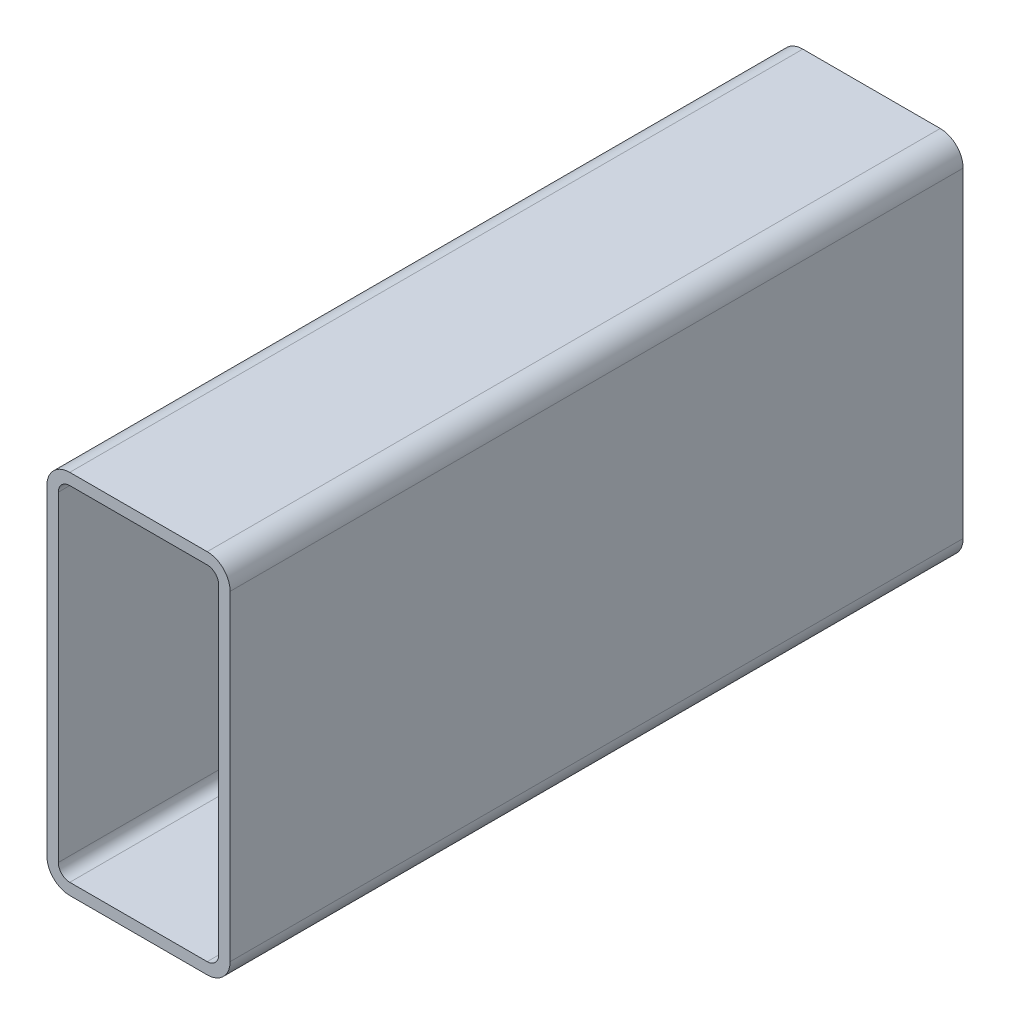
ISO-10303-21;
HEADER;
FILE_DESCRIPTION(('STEP AP214'),'2;1');
FILE_NAME('part.step','',(''),(''),'','','');
FILE_SCHEMA(('AUTOMOTIVE_DESIGN { 1 0 10303 214 1 1 1 1 }'));
ENDSEC;
DATA;
#1=APPLICATION_CONTEXT('core data for automotive mechanical design processes');
#2=APPLICATION_PROTOCOL_DEFINITION('international standard','automotive_design',2000,#1);
#3=PRODUCT_CONTEXT('',#1,'mechanical');
#4=PRODUCT('Part','Part','',(#3));
#5=PRODUCT_RELATED_PRODUCT_CATEGORY('part','',(#4));
#6=PRODUCT_DEFINITION_FORMATION('','',#4);
#7=PRODUCT_DEFINITION_CONTEXT('part definition',#1,'design');
#8=PRODUCT_DEFINITION('design','',#6,#7);
#9=PRODUCT_DEFINITION_SHAPE('','',#8);
#10=(LENGTH_UNIT() NAMED_UNIT(*) SI_UNIT(.MILLI.,.METRE.));
#11=(NAMED_UNIT(*) PLANE_ANGLE_UNIT() SI_UNIT($,.RADIAN.));
#12=(NAMED_UNIT(*) SI_UNIT($,.STERADIAN.) SOLID_ANGLE_UNIT());
#13=UNCERTAINTY_MEASURE_WITH_UNIT(LENGTH_MEASURE(1.E-05),#10,'distance_accuracy_value','');
#14=(GEOMETRIC_REPRESENTATION_CONTEXT(3) GLOBAL_UNCERTAINTY_ASSIGNED_CONTEXT((#13)) GLOBAL_UNIT_ASSIGNED_CONTEXT((#10,
#11,#12)) REPRESENTATION_CONTEXT('',''));
#15=CARTESIAN_POINT('',(0.,0.,0.));
#16=DIRECTION('',(0.,0.,1.));
#17=DIRECTION('',(1.,0.,0.));
#18=AXIS2_PLACEMENT_3D('',#15,#16,#17);
#19=CARTESIAN_POINT('',(12.0141160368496,144.886948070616,304.8));
#20=DIRECTION('',(0.,0.,1.));
#21=DIRECTION('',(1.,0.,0.));
#22=AXIS2_PLACEMENT_3D('',#19,#20,#21);
#23=PLANE('',#22);
#24=CARTESIAN_POINT('',(12.0141160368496,144.886948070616,304.8));
#25=DIRECTION('',(0.,0.,1.));
#26=DIRECTION('',(1.,0.,0.));
#27=AXIS2_PLACEMENT_3D('',#24,#25,#26);
#28=CIRCLE('',#27,9.52500000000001);
#29=CARTESIAN_POINT('',(12.0141160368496,154.411948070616,304.8));
#30=VERTEX_POINT('',#29);
#31=CARTESIAN_POINT('',(2.48911603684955,144.886948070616,304.8));
#32=VERTEX_POINT('',#31);
#33=EDGE_CURVE('E211',#30,#32,#28,.T.);
#34=ORIENTED_EDGE('',*,*,#33,.T.);
#35=DIRECTION('',(0.,-1.,0.));
#36=VECTOR('',#35,1.);
#37=CARTESIAN_POINT('',(2.48911603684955,11.5369480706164,304.8));
#38=LINE('',#37,#36);
#39=CARTESIAN_POINT('',(2.48911603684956,11.5369480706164,304.8));
#40=VERTEX_POINT('',#39);
#41=EDGE_CURVE('E214',#32,#40,#38,.T.);
#42=ORIENTED_EDGE('',*,*,#41,.T.);
#43=CARTESIAN_POINT('',(12.0141160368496,11.5369480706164,304.8));
#44=DIRECTION('',(0.,0.,1.));
#45=DIRECTION('',(1.,0.,0.));
#46=AXIS2_PLACEMENT_3D('',#43,#44,#45);
#47=CIRCLE('',#46,9.525);
#48=CARTESIAN_POINT('',(12.0141160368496,2.01194807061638,304.8));
#49=VERTEX_POINT('',#48);
#50=EDGE_CURVE('E217',#40,#49,#47,.T.);
#51=ORIENTED_EDGE('',*,*,#50,.T.);
#52=DIRECTION('',(1.,0.,0.));
#53=VECTOR('',#52,1.);
#54=CARTESIAN_POINT('',(69.1641160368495,2.01194807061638,304.8));
#55=LINE('',#54,#53);
#56=CARTESIAN_POINT('',(69.1641160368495,2.01194807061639,304.8));
#57=VERTEX_POINT('',#56);
#58=EDGE_CURVE('E219',#49,#57,#55,.T.);
#59=ORIENTED_EDGE('',*,*,#58,.T.);
#60=CARTESIAN_POINT('',(69.1641160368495,11.5369480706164,304.8));
#61=DIRECTION('',(0.,0.,1.));
#62=DIRECTION('',(1.,0.,0.));
#63=AXIS2_PLACEMENT_3D('',#60,#61,#62);
#64=CIRCLE('',#63,9.525);
#65=CARTESIAN_POINT('',(78.6891160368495,11.5369480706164,304.8));
#66=VERTEX_POINT('',#65);
#67=EDGE_CURVE('E221',#57,#66,#64,.T.);
#68=ORIENTED_EDGE('',*,*,#67,.T.);
#69=DIRECTION('',(0.,1.,0.));
#70=VECTOR('',#69,1.);
#71=CARTESIAN_POINT('',(78.6891160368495,144.886948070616,304.8));
#72=LINE('',#71,#70);
#73=CARTESIAN_POINT('',(78.6891160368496,144.886948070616,304.8));
#74=VERTEX_POINT('',#73);
#75=EDGE_CURVE('E223',#66,#74,#72,.T.);
#76=ORIENTED_EDGE('',*,*,#75,.T.);
#77=CARTESIAN_POINT('',(69.1641160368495,144.886948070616,304.8));
#78=DIRECTION('',(0.,0.,1.));
#79=DIRECTION('',(1.,0.,0.));
#80=AXIS2_PLACEMENT_3D('',#77,#78,#79);
#81=CIRCLE('',#80,9.525);
#82=CARTESIAN_POINT('',(69.1641160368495,154.411948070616,304.8));
#83=VERTEX_POINT('',#82);
#84=EDGE_CURVE('E225',#74,#83,#81,.T.);
#85=ORIENTED_EDGE('',*,*,#84,.T.);
#86=DIRECTION('',(-1.,0.,0.));
#87=VECTOR('',#86,1.);
#88=CARTESIAN_POINT('',(12.0141160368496,154.411948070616,304.8));
#89=LINE('',#88,#87);
#90=EDGE_CURVE('E227',#83,#30,#89,.T.);
#91=ORIENTED_EDGE('',*,*,#90,.T.);
#92=EDGE_LOOP('',(#34,#42,#51,#59,#68,#76,#85,#91));
#93=FACE_BOUND('',#92,.T.);
#94=DIRECTION('',(0.,-1.,0.));
#95=VECTOR('',#94,1.);
#96=CARTESIAN_POINT('',(7.25161603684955,11.5369480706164,304.8));
#97=LINE('',#96,#95);
#98=CARTESIAN_POINT('',(7.25161603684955,144.886948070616,304.8));
#99=VERTEX_POINT('',#98);
#100=CARTESIAN_POINT('',(7.25161603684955,11.5369480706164,304.8));
#101=VERTEX_POINT('',#100);
#102=EDGE_CURVE('E154',#99,#101,#97,.T.);
#103=ORIENTED_EDGE('',*,*,#102,.F.);
#104=CARTESIAN_POINT('',(12.0141160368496,144.886948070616,304.8));
#105=DIRECTION('',(0.,0.,1.));
#106=DIRECTION('',(1.,0.,0.));
#107=AXIS2_PLACEMENT_3D('',#104,#105,#106);
#108=CIRCLE('',#107,4.7625);
#109=CARTESIAN_POINT('',(12.0141160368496,149.649448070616,304.8));
#110=VERTEX_POINT('',#109);
#111=EDGE_CURVE('E146',#110,#99,#108,.T.);
#112=ORIENTED_EDGE('',*,*,#111,.F.);
#113=DIRECTION('',(-1.,0.,0.));
#114=VECTOR('',#113,1.);
#115=CARTESIAN_POINT('',(12.0141160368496,149.649448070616,304.8));
#116=LINE('',#115,#114);
#117=CARTESIAN_POINT('',(69.1641160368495,149.649448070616,304.8));
#118=VERTEX_POINT('',#117);
#119=EDGE_CURVE('E179',#118,#110,#116,.T.);
#120=ORIENTED_EDGE('',*,*,#119,.F.);
#121=CARTESIAN_POINT('',(69.1641160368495,144.886948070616,304.8));
#122=DIRECTION('',(0.,0.,1.));
#123=DIRECTION('',(1.,0.,0.));
#124=AXIS2_PLACEMENT_3D('',#121,#122,#123);
#125=CIRCLE('',#124,4.7625);
#126=CARTESIAN_POINT('',(73.9266160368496,144.886948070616,304.8));
#127=VERTEX_POINT('',#126);
#128=EDGE_CURVE('E177',#127,#118,#125,.T.);
#129=ORIENTED_EDGE('',*,*,#128,.F.);
#130=DIRECTION('',(0.,1.,0.));
#131=VECTOR('',#130,1.);
#132=CARTESIAN_POINT('',(73.9266160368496,144.886948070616,304.8));
#133=LINE('',#132,#131);
#134=CARTESIAN_POINT('',(73.9266160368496,11.5369480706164,304.8));
#135=VERTEX_POINT('',#134);
#136=EDGE_CURVE('E175',#135,#127,#133,.T.);
#137=ORIENTED_EDGE('',*,*,#136,.F.);
#138=CARTESIAN_POINT('',(69.1641160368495,11.5369480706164,304.8));
#139=DIRECTION('',(0.,0.,1.));
#140=DIRECTION('',(1.,0.,0.));
#141=AXIS2_PLACEMENT_3D('',#138,#139,#140);
#142=CIRCLE('',#141,4.7625);
#143=CARTESIAN_POINT('',(69.1641160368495,6.77444807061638,304.8));
#144=VERTEX_POINT('',#143);
#145=EDGE_CURVE('E173',#144,#135,#142,.T.);
#146=ORIENTED_EDGE('',*,*,#145,.F.);
#147=DIRECTION('',(1.,0.,0.));
#148=VECTOR('',#147,1.);
#149=CARTESIAN_POINT('',(69.1641160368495,6.77444807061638,304.8));
#150=LINE('',#149,#148);
#151=CARTESIAN_POINT('',(12.0141160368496,6.77444807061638,304.8));
#152=VERTEX_POINT('',#151);
#153=EDGE_CURVE('E169',#152,#144,#150,.T.);
#154=ORIENTED_EDGE('',*,*,#153,.F.);
#155=CARTESIAN_POINT('',(12.0141160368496,11.5369480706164,304.8));
#156=DIRECTION('',(0.,0.,1.));
#157=DIRECTION('',(1.,0.,0.));
#158=AXIS2_PLACEMENT_3D('',#155,#156,#157);
#159=CIRCLE('',#158,4.7625);
#160=EDGE_CURVE('E167',#101,#152,#159,.T.);
#161=ORIENTED_EDGE('',*,*,#160,.F.);
#162=EDGE_LOOP('',(#103,#112,#120,#129,#137,#146,#154,#161));
#163=FACE_BOUND('',#162,.T.);
#164=ADVANCED_FACE('F33',(#93,#163),#23,.T.);
#165=CARTESIAN_POINT('',(12.0141160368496,144.886948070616,0.));
#166=DIRECTION('',(0.,0.,1.));
#167=DIRECTION('',(1.,0.,0.));
#168=AXIS2_PLACEMENT_3D('',#165,#166,#167);
#169=PLANE('',#168);
#170=CARTESIAN_POINT('',(12.0141160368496,144.886948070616,0.));
#171=DIRECTION('',(0.,0.,1.));
#172=DIRECTION('',(1.,0.,0.));
#173=AXIS2_PLACEMENT_3D('',#170,#171,#172);
#174=CIRCLE('',#173,9.52500000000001);
#175=CARTESIAN_POINT('',(12.0141160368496,154.411948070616,0.));
#176=VERTEX_POINT('',#175);
#177=CARTESIAN_POINT('',(2.48911603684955,144.886948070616,0.));
#178=VERTEX_POINT('',#177);
#179=EDGE_CURVE('E162',#176,#178,#174,.T.);
#180=ORIENTED_EDGE('',*,*,#179,.F.);
#181=DIRECTION('',(-1.,0.,0.));
#182=VECTOR('',#181,1.);
#183=CARTESIAN_POINT('',(12.0141160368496,154.411948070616,0.));
#184=LINE('',#183,#182);
#185=CARTESIAN_POINT('',(69.1641160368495,154.411948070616,0.));
#186=VERTEX_POINT('',#185);
#187=EDGE_CURVE('E215',#186,#176,#184,.T.);
#188=ORIENTED_EDGE('',*,*,#187,.F.);
#189=CARTESIAN_POINT('',(69.1641160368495,144.886948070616,0.));
#190=DIRECTION('',(0.,0.,1.));
#191=DIRECTION('',(1.,0.,0.));
#192=AXIS2_PLACEMENT_3D('',#189,#190,#191);
#193=CIRCLE('',#192,9.525);
#194=CARTESIAN_POINT('',(78.6891160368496,144.886948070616,0.));
#195=VERTEX_POINT('',#194);
#196=EDGE_CURVE('E242',#195,#186,#193,.T.);
#197=ORIENTED_EDGE('',*,*,#196,.F.);
#198=DIRECTION('',(0.,1.,0.));
#199=VECTOR('',#198,1.);
#200=CARTESIAN_POINT('',(78.6891160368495,144.886948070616,0.));
#201=LINE('',#200,#199);
#202=CARTESIAN_POINT('',(78.6891160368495,11.5369480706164,0.));
#203=VERTEX_POINT('',#202);
#204=EDGE_CURVE('E240',#203,#195,#201,.T.);
#205=ORIENTED_EDGE('',*,*,#204,.F.);
#206=CARTESIAN_POINT('',(69.1641160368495,11.5369480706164,0.));
#207=DIRECTION('',(0.,0.,1.));
#208=DIRECTION('',(1.,0.,0.));
#209=AXIS2_PLACEMENT_3D('',#206,#207,#208);
#210=CIRCLE('',#209,9.525);
#211=CARTESIAN_POINT('',(69.1641160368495,2.01194807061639,0.));
#212=VERTEX_POINT('',#211);
#213=EDGE_CURVE('E238',#212,#203,#210,.T.);
#214=ORIENTED_EDGE('',*,*,#213,.F.);
#215=DIRECTION('',(1.,0.,0.));
#216=VECTOR('',#215,1.);
#217=CARTESIAN_POINT('',(69.1641160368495,2.01194807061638,0.));
#218=LINE('',#217,#216);
#219=CARTESIAN_POINT('',(12.0141160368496,2.01194807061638,0.));
#220=VERTEX_POINT('',#219);
#221=EDGE_CURVE('E236',#220,#212,#218,.T.);
#222=ORIENTED_EDGE('',*,*,#221,.F.);
#223=CARTESIAN_POINT('',(12.0141160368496,11.5369480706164,0.));
#224=DIRECTION('',(0.,0.,1.));
#225=DIRECTION('',(1.,0.,0.));
#226=AXIS2_PLACEMENT_3D('',#223,#224,#225);
#227=CIRCLE('',#226,9.525);
#228=CARTESIAN_POINT('',(2.48911603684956,11.5369480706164,0.));
#229=VERTEX_POINT('',#228);
#230=EDGE_CURVE('E234',#229,#220,#227,.T.);
#231=ORIENTED_EDGE('',*,*,#230,.F.);
#232=DIRECTION('',(0.,-1.,0.));
#233=VECTOR('',#232,1.);
#234=CARTESIAN_POINT('',(2.48911603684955,11.5369480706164,0.));
#235=LINE('',#234,#233);
#236=EDGE_CURVE('E232',#178,#229,#235,.T.);
#237=ORIENTED_EDGE('',*,*,#236,.F.);
#238=EDGE_LOOP('',(#180,#188,#197,#205,#214,#222,#231,#237));
#239=FACE_BOUND('',#238,.T.);
#240=CARTESIAN_POINT('',(12.0141160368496,144.886948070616,0.));
#241=DIRECTION('',(0.,0.,1.));
#242=DIRECTION('',(1.,0.,0.));
#243=AXIS2_PLACEMENT_3D('',#240,#241,#242);
#244=CIRCLE('',#243,4.7625);
#245=CARTESIAN_POINT('',(12.0141160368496,149.649448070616,0.));
#246=VERTEX_POINT('',#245);
#247=CARTESIAN_POINT('',(7.25161603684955,144.886948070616,0.));
#248=VERTEX_POINT('',#247);
#249=EDGE_CURVE('E56',#246,#248,#244,.T.);
#250=ORIENTED_EDGE('',*,*,#249,.T.);
#251=DIRECTION('',(0.,-1.,0.));
#252=VECTOR('',#251,1.);
#253=CARTESIAN_POINT('',(7.25161603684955,11.5369480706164,0.));
#254=LINE('',#253,#252);
#255=CARTESIAN_POINT('',(7.25161603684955,11.5369480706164,0.));
#256=VERTEX_POINT('',#255);
#257=EDGE_CURVE('E161',#248,#256,#254,.T.);
#258=ORIENTED_EDGE('',*,*,#257,.T.);
#259=CARTESIAN_POINT('',(12.0141160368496,11.5369480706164,0.));
#260=DIRECTION('',(0.,0.,1.));
#261=DIRECTION('',(1.,0.,0.));
#262=AXIS2_PLACEMENT_3D('',#259,#260,#261);
#263=CIRCLE('',#262,4.7625);
#264=CARTESIAN_POINT('',(12.0141160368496,6.77444807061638,0.));
#265=VERTEX_POINT('',#264);
#266=EDGE_CURVE('E183',#256,#265,#263,.T.);
#267=ORIENTED_EDGE('',*,*,#266,.T.);
#268=DIRECTION('',(1.,0.,0.));
#269=VECTOR('',#268,1.);
#270=CARTESIAN_POINT('',(69.1641160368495,6.77444807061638,0.));
#271=LINE('',#270,#269);
#272=CARTESIAN_POINT('',(69.1641160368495,6.77444807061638,0.));
#273=VERTEX_POINT('',#272);
#274=EDGE_CURVE('E186',#265,#273,#271,.T.);
#275=ORIENTED_EDGE('',*,*,#274,.T.);
#276=CARTESIAN_POINT('',(69.1641160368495,11.5369480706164,0.));
#277=DIRECTION('',(0.,0.,1.));
#278=DIRECTION('',(1.,0.,0.));
#279=AXIS2_PLACEMENT_3D('',#276,#277,#278);
#280=CIRCLE('',#279,4.7625);
#281=CARTESIAN_POINT('',(73.9266160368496,11.5369480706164,0.));
#282=VERTEX_POINT('',#281);
#283=EDGE_CURVE('E189',#273,#282,#280,.T.);
#284=ORIENTED_EDGE('',*,*,#283,.T.);
#285=DIRECTION('',(0.,1.,0.));
#286=VECTOR('',#285,1.);
#287=CARTESIAN_POINT('',(73.9266160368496,144.886948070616,0.));
#288=LINE('',#287,#286);
#289=CARTESIAN_POINT('',(73.9266160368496,144.886948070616,0.));
#290=VERTEX_POINT('',#289);
#291=EDGE_CURVE('E192',#282,#290,#288,.T.);
#292=ORIENTED_EDGE('',*,*,#291,.T.);
#293=CARTESIAN_POINT('',(69.1641160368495,144.886948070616,0.));
#294=DIRECTION('',(0.,0.,1.));
#295=DIRECTION('',(1.,0.,0.));
#296=AXIS2_PLACEMENT_3D('',#293,#294,#295);
#297=CIRCLE('',#296,4.7625);
#298=CARTESIAN_POINT('',(69.1641160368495,149.649448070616,0.));
#299=VERTEX_POINT('',#298);
#300=EDGE_CURVE('E195',#290,#299,#297,.T.);
#301=ORIENTED_EDGE('',*,*,#300,.T.);
#302=DIRECTION('',(-1.,0.,0.));
#303=VECTOR('',#302,1.);
#304=CARTESIAN_POINT('',(12.0141160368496,149.649448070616,0.));
#305=LINE('',#304,#303);
#306=EDGE_CURVE('E155',#299,#246,#305,.T.);
#307=ORIENTED_EDGE('',*,*,#306,.T.);
#308=EDGE_LOOP('',(#250,#258,#267,#275,#284,#292,#301,#307));
#309=FACE_BOUND('',#308,.T.);
#310=ADVANCED_FACE('F272',(#239,#309),#169,.F.);
#311=CARTESIAN_POINT('',(12.0141160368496,144.886948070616,304.8));
#312=DIRECTION('',(0.,0.,-1.));
#313=DIRECTION('',(-1.,0.,0.));
#314=AXIS2_PLACEMENT_3D('',#311,#312,#313);
#315=CYLINDRICAL_SURFACE('',#314,9.52500000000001);
#316=ORIENTED_EDGE('',*,*,#179,.T.);
#317=DIRECTION('',(0.,0.,-1.));
#318=VECTOR('',#317,1.);
#319=CARTESIAN_POINT('',(2.48911603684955,144.886948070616,304.8));
#320=LINE('',#319,#318);
#321=EDGE_CURVE('E11',#32,#178,#320,.T.);
#322=ORIENTED_EDGE('',*,*,#321,.F.);
#323=ORIENTED_EDGE('',*,*,#33,.F.);
#324=DIRECTION('',(0.,0.,-1.));
#325=VECTOR('',#324,1.);
#326=CARTESIAN_POINT('',(12.0141160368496,154.411948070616,304.8));
#327=LINE('',#326,#325);
#328=EDGE_CURVE('E229',#30,#176,#327,.T.);
#329=ORIENTED_EDGE('',*,*,#328,.T.);
#330=EDGE_LOOP('',(#316,#322,#323,#329));
#331=FACE_BOUND('',#330,.T.);
#332=ADVANCED_FACE('F35',(#331),#315,.T.);
#333=CARTESIAN_POINT('',(2.48911603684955,11.5369480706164,304.8));
#334=DIRECTION('',(1.,0.,0.));
#335=DIRECTION('',(0.,0.,-1.));
#336=AXIS2_PLACEMENT_3D('',#333,#334,#335);
#337=PLANE('',#336);
#338=ORIENTED_EDGE('',*,*,#236,.T.);
#339=DIRECTION('',(0.,0.,-1.));
#340=VECTOR('',#339,1.);
#341=CARTESIAN_POINT('',(2.48911603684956,11.5369480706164,304.8));
#342=LINE('',#341,#340);
#343=EDGE_CURVE('E41',#40,#229,#342,.T.);
#344=ORIENTED_EDGE('',*,*,#343,.F.);
#345=ORIENTED_EDGE('',*,*,#41,.F.);
#346=ORIENTED_EDGE('',*,*,#321,.T.);
#347=EDGE_LOOP('',(#338,#344,#345,#346));
#348=FACE_BOUND('',#347,.T.);
#349=ADVANCED_FACE('F289',(#348),#337,.F.);
#350=CARTESIAN_POINT('',(12.0141160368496,11.5369480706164,304.8));
#351=DIRECTION('',(0.,0.,-1.));
#352=DIRECTION('',(-1.,0.,0.));
#353=AXIS2_PLACEMENT_3D('',#350,#351,#352);
#354=CYLINDRICAL_SURFACE('',#353,9.525);
#355=ORIENTED_EDGE('',*,*,#230,.T.);
#356=DIRECTION('',(0.,0.,-1.));
#357=VECTOR('',#356,1.);
#358=CARTESIAN_POINT('',(12.0141160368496,2.01194807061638,304.8));
#359=LINE('',#358,#357);
#360=EDGE_CURVE('E259',#49,#220,#359,.T.);
#361=ORIENTED_EDGE('',*,*,#360,.F.);
#362=ORIENTED_EDGE('',*,*,#50,.F.);
#363=ORIENTED_EDGE('',*,*,#343,.T.);
#364=EDGE_LOOP('',(#355,#361,#362,#363));
#365=FACE_BOUND('',#364,.T.);
#366=ADVANCED_FACE('F266',(#365),#354,.T.);
#367=CARTESIAN_POINT('',(69.1641160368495,2.01194807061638,304.8));
#368=DIRECTION('',(0.,1.,0.));
#369=DIRECTION('',(0.,0.,1.));
#370=AXIS2_PLACEMENT_3D('',#367,#368,#369);
#371=PLANE('',#370);
#372=ORIENTED_EDGE('',*,*,#221,.T.);
#373=DIRECTION('',(0.,0.,-1.));
#374=VECTOR('',#373,1.);
#375=CARTESIAN_POINT('',(69.1641160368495,2.01194807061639,304.8));
#376=LINE('',#375,#374);
#377=EDGE_CURVE('E256',#57,#212,#376,.T.);
#378=ORIENTED_EDGE('',*,*,#377,.F.);
#379=ORIENTED_EDGE('',*,*,#58,.F.);
#380=ORIENTED_EDGE('',*,*,#360,.T.);
#381=EDGE_LOOP('',(#372,#378,#379,#380));
#382=FACE_BOUND('',#381,.T.);
#383=ADVANCED_FACE('F278',(#382),#371,.F.);
#384=CARTESIAN_POINT('',(69.1641160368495,11.5369480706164,304.8));
#385=DIRECTION('',(0.,0.,-1.));
#386=DIRECTION('',(-1.,0.,0.));
#387=AXIS2_PLACEMENT_3D('',#384,#385,#386);
#388=CYLINDRICAL_SURFACE('',#387,9.525);
#389=ORIENTED_EDGE('',*,*,#213,.T.);
#390=DIRECTION('',(0.,0.,-1.));
#391=VECTOR('',#390,1.);
#392=CARTESIAN_POINT('',(78.6891160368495,11.5369480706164,304.8));
#393=LINE('',#392,#391);
#394=EDGE_CURVE('E253',#66,#203,#393,.T.);
#395=ORIENTED_EDGE('',*,*,#394,.F.);
#396=ORIENTED_EDGE('',*,*,#67,.F.);
#397=ORIENTED_EDGE('',*,*,#377,.T.);
#398=EDGE_LOOP('',(#389,#395,#396,#397));
#399=FACE_BOUND('',#398,.T.);
#400=ADVANCED_FACE('F282',(#399),#388,.T.);
#401=CARTESIAN_POINT('',(78.6891160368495,144.886948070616,304.8));
#402=DIRECTION('',(-1.,0.,0.));
#403=DIRECTION('',(0.,0.,1.));
#404=AXIS2_PLACEMENT_3D('',#401,#402,#403);
#405=PLANE('',#404);
#406=ORIENTED_EDGE('',*,*,#204,.T.);
#407=DIRECTION('',(0.,0.,-1.));
#408=VECTOR('',#407,1.);
#409=CARTESIAN_POINT('',(78.6891160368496,144.886948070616,304.8));
#410=LINE('',#409,#408);
#411=EDGE_CURVE('E250',#74,#195,#410,.T.);
#412=ORIENTED_EDGE('',*,*,#411,.F.);
#413=ORIENTED_EDGE('',*,*,#75,.F.);
#414=ORIENTED_EDGE('',*,*,#394,.T.);
#415=EDGE_LOOP('',(#406,#412,#413,#414));
#416=FACE_BOUND('',#415,.T.);
#417=ADVANCED_FACE('F302',(#416),#405,.F.);
#418=CARTESIAN_POINT('',(69.1641160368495,144.886948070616,304.8));
#419=DIRECTION('',(0.,0.,-1.));
#420=DIRECTION('',(-1.,0.,0.));
#421=AXIS2_PLACEMENT_3D('',#418,#419,#420);
#422=CYLINDRICAL_SURFACE('',#421,9.525);
#423=ORIENTED_EDGE('',*,*,#196,.T.);
#424=DIRECTION('',(0.,0.,-1.));
#425=VECTOR('',#424,1.);
#426=CARTESIAN_POINT('',(69.1641160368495,154.411948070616,304.8));
#427=LINE('',#426,#425);
#428=EDGE_CURVE('E247',#83,#186,#427,.T.);
#429=ORIENTED_EDGE('',*,*,#428,.F.);
#430=ORIENTED_EDGE('',*,*,#84,.F.);
#431=ORIENTED_EDGE('',*,*,#411,.T.);
#432=EDGE_LOOP('',(#423,#429,#430,#431));
#433=FACE_BOUND('',#432,.T.);
#434=ADVANCED_FACE('F300',(#433),#422,.T.);
#435=CARTESIAN_POINT('',(12.0141160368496,154.411948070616,304.8));
#436=DIRECTION('',(0.,-1.,0.));
#437=DIRECTION('',(0.,0.,-1.));
#438=AXIS2_PLACEMENT_3D('',#435,#436,#437);
#439=PLANE('',#438);
#440=ORIENTED_EDGE('',*,*,#187,.T.);
#441=ORIENTED_EDGE('',*,*,#328,.F.);
#442=ORIENTED_EDGE('',*,*,#90,.F.);
#443=ORIENTED_EDGE('',*,*,#428,.T.);
#444=EDGE_LOOP('',(#440,#441,#442,#443));
#445=FACE_BOUND('',#444,.T.);
#446=ADVANCED_FACE('F295',(#445),#439,.F.);
#447=CARTESIAN_POINT('',(12.0141160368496,144.886948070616,304.8));
#448=DIRECTION('',(0.,0.,-1.));
#449=DIRECTION('',(-1.,0.,0.));
#450=AXIS2_PLACEMENT_3D('',#447,#448,#449);
#451=CYLINDRICAL_SURFACE('',#450,4.7625);
#452=ORIENTED_EDGE('',*,*,#249,.F.);
#453=DIRECTION('',(0.,0.,-1.));
#454=VECTOR('',#453,1.);
#455=CARTESIAN_POINT('',(12.0141160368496,149.649448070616,304.8));
#456=LINE('',#455,#454);
#457=EDGE_CURVE('E150',#110,#246,#456,.T.);
#458=ORIENTED_EDGE('',*,*,#457,.F.);
#459=ORIENTED_EDGE('',*,*,#111,.T.);
#460=DIRECTION('',(0.,0.,-1.));
#461=VECTOR('',#460,1.);
#462=CARTESIAN_POINT('',(7.25161603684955,144.886948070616,304.8));
#463=LINE('',#462,#461);
#464=EDGE_CURVE('E149',#99,#248,#463,.T.);
#465=ORIENTED_EDGE('',*,*,#464,.T.);
#466=EDGE_LOOP('',(#452,#458,#459,#465));
#467=FACE_BOUND('',#466,.T.);
#468=ADVANCED_FACE('F148',(#467),#451,.F.);
#469=CARTESIAN_POINT('',(7.25161603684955,11.5369480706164,304.8));
#470=DIRECTION('',(1.,0.,0.));
#471=DIRECTION('',(0.,0.,-1.));
#472=AXIS2_PLACEMENT_3D('',#469,#470,#471);
#473=PLANE('',#472);
#474=ORIENTED_EDGE('',*,*,#257,.F.);
#475=ORIENTED_EDGE('',*,*,#464,.F.);
#476=ORIENTED_EDGE('',*,*,#102,.T.);
#477=DIRECTION('',(0.,0.,-1.));
#478=VECTOR('',#477,1.);
#479=CARTESIAN_POINT('',(7.25161603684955,11.5369480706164,304.8));
#480=LINE('',#479,#478);
#481=EDGE_CURVE('E163',#101,#256,#480,.T.);
#482=ORIENTED_EDGE('',*,*,#481,.T.);
#483=EDGE_LOOP('',(#474,#475,#476,#482));
#484=FACE_BOUND('',#483,.T.);
#485=ADVANCED_FACE('F158',(#484),#473,.T.);
#486=CARTESIAN_POINT('',(12.0141160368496,11.5369480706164,304.8));
#487=DIRECTION('',(0.,0.,-1.));
#488=DIRECTION('',(-1.,0.,0.));
#489=AXIS2_PLACEMENT_3D('',#486,#487,#488);
#490=CYLINDRICAL_SURFACE('',#489,4.7625);
#491=ORIENTED_EDGE('',*,*,#266,.F.);
#492=ORIENTED_EDGE('',*,*,#481,.F.);
#493=ORIENTED_EDGE('',*,*,#160,.T.);
#494=DIRECTION('',(0.,0.,-1.));
#495=VECTOR('',#494,1.);
#496=CARTESIAN_POINT('',(12.0141160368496,6.77444807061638,304.8));
#497=LINE('',#496,#495);
#498=EDGE_CURVE('E208',#152,#265,#497,.T.);
#499=ORIENTED_EDGE('',*,*,#498,.T.);
#500=EDGE_LOOP('',(#491,#492,#493,#499));
#501=FACE_BOUND('',#500,.T.);
#502=ADVANCED_FACE('F327',(#501),#490,.F.);
#503=CARTESIAN_POINT('',(69.1641160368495,6.77444807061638,304.8));
#504=DIRECTION('',(0.,1.,0.));
#505=DIRECTION('',(0.,0.,1.));
#506=AXIS2_PLACEMENT_3D('',#503,#504,#505);
#507=PLANE('',#506);
#508=ORIENTED_EDGE('',*,*,#274,.F.);
#509=ORIENTED_EDGE('',*,*,#498,.F.);
#510=ORIENTED_EDGE('',*,*,#153,.T.);
#511=DIRECTION('',(0.,0.,-1.));
#512=VECTOR('',#511,1.);
#513=CARTESIAN_POINT('',(69.1641160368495,6.77444807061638,304.8));
#514=LINE('',#513,#512);
#515=EDGE_CURVE('E206',#144,#273,#514,.T.);
#516=ORIENTED_EDGE('',*,*,#515,.T.);
#517=EDGE_LOOP('',(#508,#509,#510,#516));
#518=FACE_BOUND('',#517,.T.);
#519=ADVANCED_FACE('F331',(#518),#507,.T.);
#520=CARTESIAN_POINT('',(69.1641160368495,11.5369480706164,304.8));
#521=DIRECTION('',(0.,0.,-1.));
#522=DIRECTION('',(-1.,0.,0.));
#523=AXIS2_PLACEMENT_3D('',#520,#521,#522);
#524=CYLINDRICAL_SURFACE('',#523,4.7625);
#525=ORIENTED_EDGE('',*,*,#283,.F.);
#526=ORIENTED_EDGE('',*,*,#515,.F.);
#527=ORIENTED_EDGE('',*,*,#145,.T.);
#528=DIRECTION('',(0.,0.,-1.));
#529=VECTOR('',#528,1.);
#530=CARTESIAN_POINT('',(73.9266160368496,11.5369480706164,304.8));
#531=LINE('',#530,#529);
#532=EDGE_CURVE('E204',#135,#282,#531,.T.);
#533=ORIENTED_EDGE('',*,*,#532,.T.);
#534=EDGE_LOOP('',(#525,#526,#527,#533));
#535=FACE_BOUND('',#534,.T.);
#536=ADVANCED_FACE('F337',(#535),#524,.F.);
#537=CARTESIAN_POINT('',(73.9266160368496,144.886948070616,304.8));
#538=DIRECTION('',(-1.,0.,0.));
#539=DIRECTION('',(0.,0.,1.));
#540=AXIS2_PLACEMENT_3D('',#537,#538,#539);
#541=PLANE('',#540);
#542=ORIENTED_EDGE('',*,*,#291,.F.);
#543=ORIENTED_EDGE('',*,*,#532,.F.);
#544=ORIENTED_EDGE('',*,*,#136,.T.);
#545=DIRECTION('',(0.,0.,-1.));
#546=VECTOR('',#545,1.);
#547=CARTESIAN_POINT('',(73.9266160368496,144.886948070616,304.8));
#548=LINE('',#547,#546);
#549=EDGE_CURVE('E202',#127,#290,#548,.T.);
#550=ORIENTED_EDGE('',*,*,#549,.T.);
#551=EDGE_LOOP('',(#542,#543,#544,#550));
#552=FACE_BOUND('',#551,.T.);
#553=ADVANCED_FACE('F341',(#552),#541,.T.);
#554=CARTESIAN_POINT('',(69.1641160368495,144.886948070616,304.8));
#555=DIRECTION('',(0.,0.,-1.));
#556=DIRECTION('',(-1.,0.,0.));
#557=AXIS2_PLACEMENT_3D('',#554,#555,#556);
#558=CYLINDRICAL_SURFACE('',#557,4.7625);
#559=ORIENTED_EDGE('',*,*,#300,.F.);
#560=ORIENTED_EDGE('',*,*,#549,.F.);
#561=ORIENTED_EDGE('',*,*,#128,.T.);
#562=DIRECTION('',(0.,0.,-1.));
#563=VECTOR('',#562,1.);
#564=CARTESIAN_POINT('',(69.1641160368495,149.649448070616,304.8));
#565=LINE('',#564,#563);
#566=EDGE_CURVE('E48',#118,#299,#565,.T.);
#567=ORIENTED_EDGE('',*,*,#566,.T.);
#568=EDGE_LOOP('',(#559,#560,#561,#567));
#569=FACE_BOUND('',#568,.T.);
#570=ADVANCED_FACE('F345',(#569),#558,.F.);
#571=CARTESIAN_POINT('',(12.0141160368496,149.649448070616,304.8));
#572=DIRECTION('',(0.,-1.,0.));
#573=DIRECTION('',(0.,0.,-1.));
#574=AXIS2_PLACEMENT_3D('',#571,#572,#573);
#575=PLANE('',#574);
#576=ORIENTED_EDGE('',*,*,#306,.F.);
#577=ORIENTED_EDGE('',*,*,#566,.F.);
#578=ORIENTED_EDGE('',*,*,#119,.T.);
#579=ORIENTED_EDGE('',*,*,#457,.T.);
#580=EDGE_LOOP('',(#576,#577,#578,#579));
#581=FACE_BOUND('',#580,.T.);
#582=ADVANCED_FACE('F349',(#581),#575,.T.);
#583=CLOSED_SHELL('',(#164,#310,#332,#349,#366,#383,#400,#417,#434,#446,#468,#485,#502,#519,
#536,#553,#570,#582));
#584=MANIFOLD_SOLID_BREP('B2',#583);
#585=ADVANCED_BREP_SHAPE_REPRESENTATION('',(#18,#584),#14);
#586=SHAPE_DEFINITION_REPRESENTATION(#9,#585);
ENDSEC;
END-ISO-10303-21;
